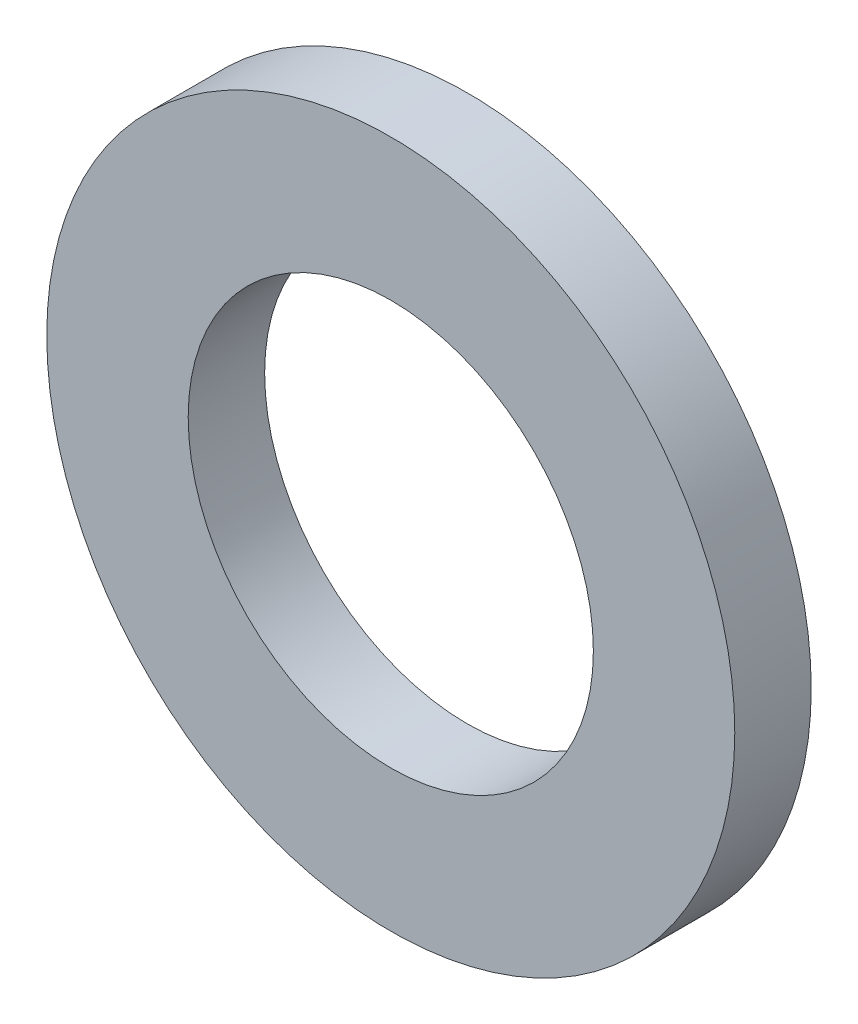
from build123d import *

# Parameters (mm, degrees)
SKETCH_1_R      = 4.5
SKETCH_1_R_2    = 2.65
EXTRUDE_1_DEPTH = 1


with BuildPart() as part:
    # Sketch 1 → Extrude 1 (new body)
    with BuildSketch(Plane.XY):
        Circle(SKETCH_1_R)
        Circle(SKETCH_1_R_2, mode=Mode.SUBTRACT)
    extrude(amount=EXTRUDE_1_DEPTH)


solid = part.part
